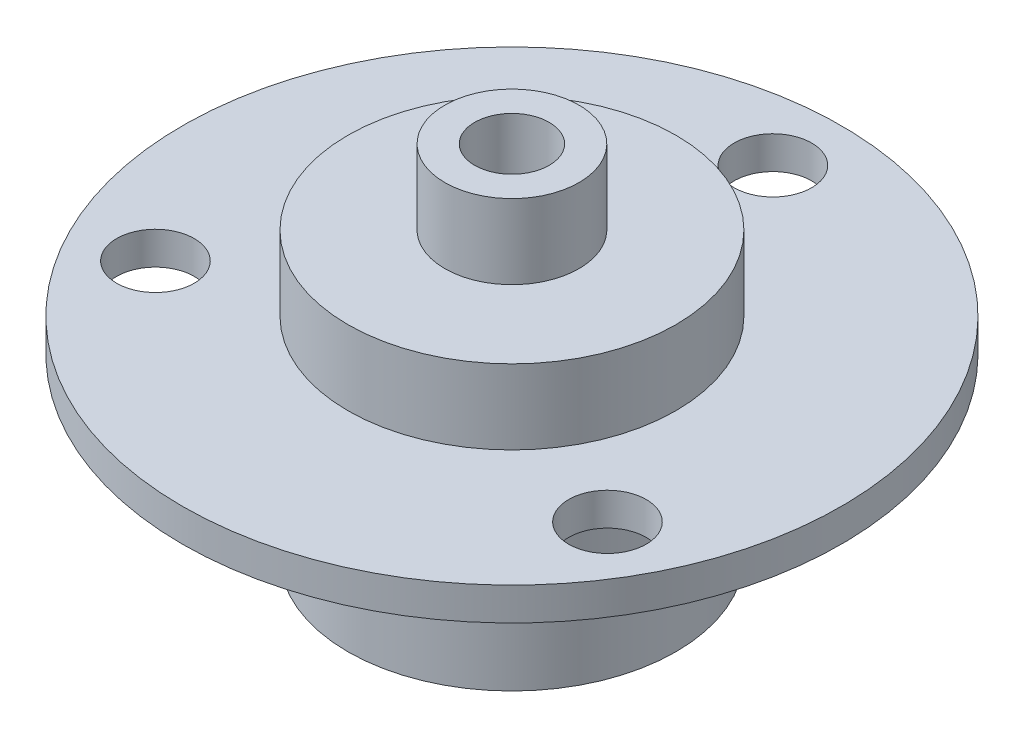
from build123d import *

# Parameters (mm, degrees)
SKETCH_2_R               = 22.1
EXTRUDE_1_DEPTH          = 2.2
CUT_EXTRUDE_1_DEPTH      = 32.331453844
CUT_EXTRUDE_1_DEPTH_BACK = 32.331453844
SKETCH_3_R               = 2.6
SKETCH_4_R               = 11
EXTRUDE_2_DEPTH          = 5
EXTRUDE_START            = 11.8
SKETCH_5_R               = 11
EXTRUDE_3_DEPTH          = 11.8
SKETCH_7_R               = 4.5
EXTRUDE_4_DEPTH          = 5
CUT_EXTRUDE_2_DEPTH      = 40.405837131
CUT_EXTRUDE_2_DEPTH_BACK = 40.405837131
SKETCH_8_R               = 2.5


with BuildPart() as part:
    # Sketch 2 → Extrude 1 (new body)
    with BuildSketch(Plane(origin=(0, 0, 0), x_dir=(1, 0, 0), z_dir=(0, 1, 0))):
        with Locations(Location((0, 0, 0), (0, 0, 270))):
            Circle(SKETCH_2_R)
    extrude(amount=EXTRUDE_1_DEPTH)

    # Sketch 3 → Cut-Extrude 1 (cut, two sides: drawn at the far end of the back side and taken through both)
    with BuildSketch(Plane(origin=(0, 2.2, 0), x_dir=(1, 0, 0), z_dir=(0, 1, 0)).offset(-CUT_EXTRUDE_1_DEPTH_BACK)):
        with Locations(Location((0, 17.5, 0), (0, 0, 270))):
            Circle(SKETCH_3_R)
        with Locations(Location((15.155444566, -8.75, 0), (0, 0, 270))):
            Circle(SKETCH_3_R)
        with Locations(Location((-15.155444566, -8.75, 0), (0, 0, 270))):
            Circle(SKETCH_3_R)
    extrude(amount=CUT_EXTRUDE_1_DEPTH + CUT_EXTRUDE_1_DEPTH_BACK, mode=Mode.SUBTRACT)

    # Sketch 4 → Extrude 2 (add)
    with BuildSketch(Plane(origin=(0, 2.2, 0), x_dir=(1, 0, 0), z_dir=(0, 1, 0))):
        with Locations(Location((0, 0, 0), (0, 0, 270))):
            Circle(SKETCH_4_R)
    extrude(amount=EXTRUDE_2_DEPTH)

    # Sketch 5 → Extrude 3 (add)
    with BuildSketch(Plane.XZ.offset(EXTRUDE_START)):
        with Locations(Location((0, 0, 0), (0, 0, 90))):
            Circle(SKETCH_5_R)
    extrude(amount=-EXTRUDE_3_DEPTH)

    # Sketch 7 → Extrude 4 (add)
    with BuildSketch(Plane(origin=(0, 7.2, 0), x_dir=(1, 0, 0), z_dir=(0, 1, 0))):
        with Locations(Location((0, 0, 0), (0, 0, 270))):
            Circle(SKETCH_7_R)
    extrude(amount=EXTRUDE_4_DEPTH)

    # Sketch 8 → Cut-Extrude 2 (cut, two sides: drawn at the far end of the back side and taken through both)
    with BuildSketch(Plane(origin=(0, 12.2, 0), x_dir=(1, 0, 0), z_dir=(0, 1, 0)).offset(-CUT_EXTRUDE_2_DEPTH_BACK)):
        with Locations(Location((0, 0, 0), (0, 0, 270))):
            Circle(SKETCH_8_R)
    extrude(amount=CUT_EXTRUDE_2_DEPTH + CUT_EXTRUDE_2_DEPTH_BACK, mode=Mode.SUBTRACT)


solid = part.part
